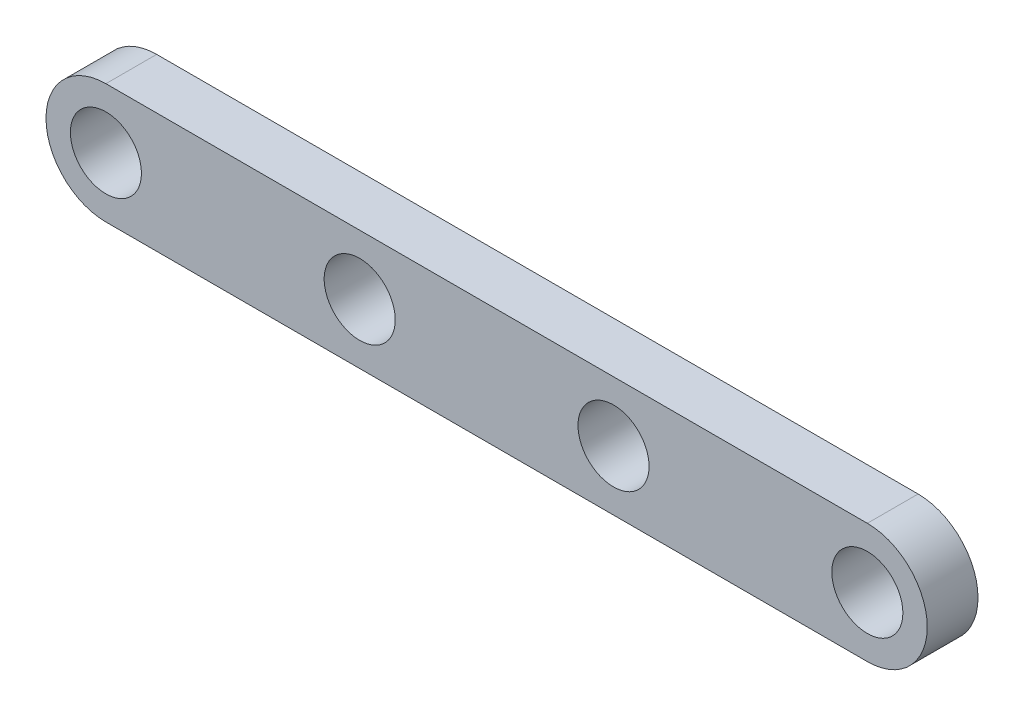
from build123d import *

# Parameters (mm, degrees)
BOSS_EXTRUDE1_DEPTH = 2.54
SKETCH3_R           = 1.778
CUT_EXTRUDE2_DEPTH  = 271.06230953


with BuildPart() as part:
    # Sketch1 → Boss-Extrude1 (new body)
    with BuildSketch(Plane.XY):
        with BuildLine():
            Line((261.537880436, 54.299085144), (223.437880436, 54.299085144))
            ThreePointArc((223.437880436, 54.299085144), (220.440680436, 51.301885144), (223.437880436, 48.304685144))
            Line((223.437880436, 48.304685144), (261.537880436, 48.304685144))
            ThreePointArc((261.537880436, 48.304685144), (264.535080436, 51.301885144), (261.537880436, 54.299085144))
        make_face()
    extrude(amount=BOSS_EXTRUDE1_DEPTH)

    # Sketch3 → Cut-Extrude2 (cut, through all)
    with BuildSketch(Plane.XY):
        with Locations((223.437880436, 51.301885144)):
            Circle(SKETCH3_R)
        with Locations((236.137880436, 51.301885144)):
            Circle(SKETCH3_R)
        with Locations((248.837880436, 51.301885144)):
            Circle(SKETCH3_R)
        with Locations((261.537880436, 51.301885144)):
            Circle(SKETCH3_R)
    extrude(amount=CUT_EXTRUDE2_DEPTH, mode=Mode.SUBTRACT)


solid = part.part
